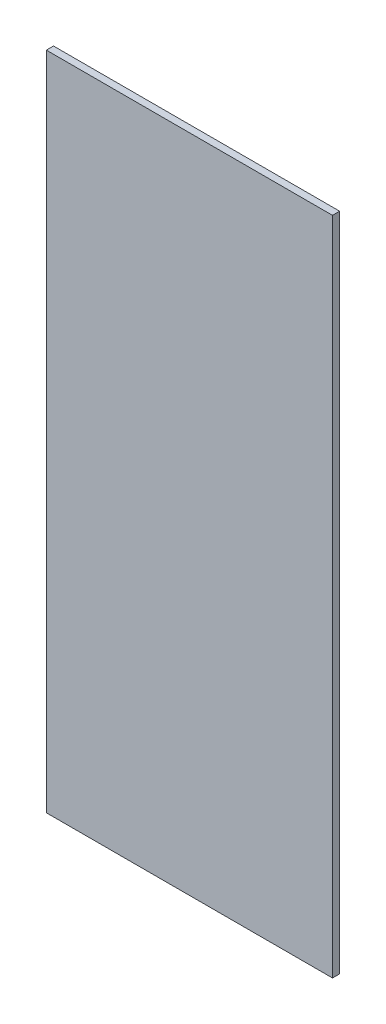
ISO-10303-21;
HEADER;
FILE_DESCRIPTION(('STEP AP214'),'2;1');
FILE_NAME('part.step','',(''),(''),'','','');
FILE_SCHEMA(('AUTOMOTIVE_DESIGN { 1 0 10303 214 1 1 1 1 }'));
ENDSEC;
DATA;
#1=APPLICATION_CONTEXT('core data for automotive mechanical design processes');
#2=APPLICATION_PROTOCOL_DEFINITION('international standard','automotive_design',2000,#1);
#3=PRODUCT_CONTEXT('',#1,'mechanical');
#4=PRODUCT('Part','Part','',(#3));
#5=PRODUCT_RELATED_PRODUCT_CATEGORY('part','',(#4));
#6=PRODUCT_DEFINITION_FORMATION('','',#4);
#7=PRODUCT_DEFINITION_CONTEXT('part definition',#1,'design');
#8=PRODUCT_DEFINITION('design','',#6,#7);
#9=PRODUCT_DEFINITION_SHAPE('','',#8);
#10=(LENGTH_UNIT() NAMED_UNIT(*) SI_UNIT(.MILLI.,.METRE.));
#11=(NAMED_UNIT(*) PLANE_ANGLE_UNIT() SI_UNIT($,.RADIAN.));
#12=(NAMED_UNIT(*) SI_UNIT($,.STERADIAN.) SOLID_ANGLE_UNIT());
#13=UNCERTAINTY_MEASURE_WITH_UNIT(LENGTH_MEASURE(1.E-05),#10,'distance_accuracy_value','');
#14=(GEOMETRIC_REPRESENTATION_CONTEXT(3) GLOBAL_UNCERTAINTY_ASSIGNED_CONTEXT((#13)) GLOBAL_UNIT_ASSIGNED_CONTEXT((#10,
#11,#12)) REPRESENTATION_CONTEXT('',''));
#15=CARTESIAN_POINT('',(0.,0.,0.));
#16=DIRECTION('',(0.,0.,1.));
#17=DIRECTION('',(1.,0.,0.));
#18=AXIS2_PLACEMENT_3D('',#15,#16,#17);
#19=CARTESIAN_POINT('',(300.,692.5,15.));
#20=DIRECTION('',(-1.,0.,0.));
#21=DIRECTION('',(0.,-1.,0.));
#22=AXIS2_PLACEMENT_3D('',#19,#20,#21);
#23=PLANE('',#22);
#24=DIRECTION('',(0.,1.,0.));
#25=VECTOR('',#24,1.);
#26=CARTESIAN_POINT('',(300.,692.5,0.));
#27=LINE('',#26,#25);
#28=CARTESIAN_POINT('',(300.,-692.5,0.));
#29=VERTEX_POINT('',#28);
#30=CARTESIAN_POINT('',(300.,692.5,0.));
#31=VERTEX_POINT('',#30);
#32=EDGE_CURVE('E111',#29,#31,#27,.T.);
#33=ORIENTED_EDGE('',*,*,#32,.T.);
#34=DIRECTION('',(0.,0.,-1.));
#35=VECTOR('',#34,1.);
#36=CARTESIAN_POINT('',(300.,692.5,15.));
#37=LINE('',#36,#35);
#38=CARTESIAN_POINT('',(300.,692.5,15.));
#39=VERTEX_POINT('',#38);
#40=EDGE_CURVE('E11',#39,#31,#37,.T.);
#41=ORIENTED_EDGE('',*,*,#40,.F.);
#42=DIRECTION('',(0.,1.,0.));
#43=VECTOR('',#42,1.);
#44=CARTESIAN_POINT('',(300.,692.5,15.));
#45=LINE('',#44,#43);
#46=CARTESIAN_POINT('',(300.,-692.5,15.));
#47=VERTEX_POINT('',#46);
#48=EDGE_CURVE('E95',#47,#39,#45,.T.);
#49=ORIENTED_EDGE('',*,*,#48,.F.);
#50=DIRECTION('',(0.,0.,-1.));
#51=VECTOR('',#50,1.);
#52=CARTESIAN_POINT('',(300.,-692.5,15.));
#53=LINE('',#52,#51);
#54=EDGE_CURVE('E107',#47,#29,#53,.T.);
#55=ORIENTED_EDGE('',*,*,#54,.T.);
#56=EDGE_LOOP('',(#33,#41,#49,#55));
#57=FACE_BOUND('',#56,.T.);
#58=ADVANCED_FACE('F43',(#57),#23,.F.);
#59=CARTESIAN_POINT('',(-300.,692.5,15.));
#60=DIRECTION('',(0.,-1.,0.));
#61=DIRECTION('',(0.,0.,-1.));
#62=AXIS2_PLACEMENT_3D('',#59,#60,#61);
#63=PLANE('',#62);
#64=DIRECTION('',(-1.,0.,0.));
#65=VECTOR('',#64,1.);
#66=CARTESIAN_POINT('',(-300.,692.5,0.));
#67=LINE('',#66,#65);
#68=CARTESIAN_POINT('',(-300.,692.5,0.));
#69=VERTEX_POINT('',#68);
#70=EDGE_CURVE('E100',#31,#69,#67,.T.);
#71=ORIENTED_EDGE('',*,*,#70,.T.);
#72=DIRECTION('',(0.,0.,-1.));
#73=VECTOR('',#72,1.);
#74=CARTESIAN_POINT('',(-300.,692.5,15.));
#75=LINE('',#74,#73);
#76=CARTESIAN_POINT('',(-300.,692.5,15.));
#77=VERTEX_POINT('',#76);
#78=EDGE_CURVE('E52',#77,#69,#75,.T.);
#79=ORIENTED_EDGE('',*,*,#78,.F.);
#80=DIRECTION('',(-1.,0.,0.));
#81=VECTOR('',#80,1.);
#82=CARTESIAN_POINT('',(-300.,692.5,15.));
#83=LINE('',#82,#81);
#84=EDGE_CURVE('E90',#39,#77,#83,.T.);
#85=ORIENTED_EDGE('',*,*,#84,.F.);
#86=ORIENTED_EDGE('',*,*,#40,.T.);
#87=EDGE_LOOP('',(#71,#79,#85,#86));
#88=FACE_BOUND('',#87,.T.);
#89=ADVANCED_FACE('F99',(#88),#63,.F.);
#90=CARTESIAN_POINT('',(-300.,692.5,15.));
#91=DIRECTION('',(1.,0.,0.));
#92=DIRECTION('',(0.,1.,0.));
#93=AXIS2_PLACEMENT_3D('',#90,#91,#92);
#94=PLANE('',#93);
#95=DIRECTION('',(0.,-1.,0.));
#96=VECTOR('',#95,1.);
#97=CARTESIAN_POINT('',(-300.,692.5,0.));
#98=LINE('',#97,#96);
#99=CARTESIAN_POINT('',(-300.,-692.5,0.));
#100=VERTEX_POINT('',#99);
#101=EDGE_CURVE('E77',#69,#100,#98,.T.);
#102=ORIENTED_EDGE('',*,*,#101,.T.);
#103=DIRECTION('',(0.,0.,-1.));
#104=VECTOR('',#103,1.);
#105=CARTESIAN_POINT('',(-300.,-692.5,15.));
#106=LINE('',#105,#104);
#107=CARTESIAN_POINT('',(-300.,-692.5,15.));
#108=VERTEX_POINT('',#107);
#109=EDGE_CURVE('E102',#108,#100,#106,.T.);
#110=ORIENTED_EDGE('',*,*,#109,.F.);
#111=DIRECTION('',(0.,-1.,0.));
#112=VECTOR('',#111,1.);
#113=CARTESIAN_POINT('',(-300.,692.5,15.));
#114=LINE('',#113,#112);
#115=EDGE_CURVE('E93',#77,#108,#114,.T.);
#116=ORIENTED_EDGE('',*,*,#115,.F.);
#117=ORIENTED_EDGE('',*,*,#78,.T.);
#118=EDGE_LOOP('',(#102,#110,#116,#117));
#119=FACE_BOUND('',#118,.T.);
#120=ADVANCED_FACE('F103',(#119),#94,.F.);
#121=CARTESIAN_POINT('',(-300.,-692.5,15.));
#122=DIRECTION('',(0.,1.,0.));
#123=DIRECTION('',(0.,0.,1.));
#124=AXIS2_PLACEMENT_3D('',#121,#122,#123);
#125=PLANE('',#124);
#126=DIRECTION('',(1.,0.,0.));
#127=VECTOR('',#126,1.);
#128=CARTESIAN_POINT('',(-300.,-692.5,0.));
#129=LINE('',#128,#127);
#130=EDGE_CURVE('E83',#100,#29,#129,.T.);
#131=ORIENTED_EDGE('',*,*,#130,.T.);
#132=ORIENTED_EDGE('',*,*,#54,.F.);
#133=DIRECTION('',(1.,0.,0.));
#134=VECTOR('',#133,1.);
#135=CARTESIAN_POINT('',(-300.,-692.5,15.));
#136=LINE('',#135,#134);
#137=EDGE_CURVE('E60',#108,#47,#136,.T.);
#138=ORIENTED_EDGE('',*,*,#137,.F.);
#139=ORIENTED_EDGE('',*,*,#109,.T.);
#140=EDGE_LOOP('',(#131,#132,#138,#139));
#141=FACE_BOUND('',#140,.T.);
#142=ADVANCED_FACE('F124',(#141),#125,.F.);
#143=CARTESIAN_POINT('',(0.,0.,15.));
#144=DIRECTION('',(0.,0.,1.));
#145=DIRECTION('',(1.,0.,0.));
#146=AXIS2_PLACEMENT_3D('',#143,#144,#145);
#147=PLANE('',#146);
#148=ORIENTED_EDGE('',*,*,#48,.T.);
#149=ORIENTED_EDGE('',*,*,#84,.T.);
#150=ORIENTED_EDGE('',*,*,#115,.T.);
#151=ORIENTED_EDGE('',*,*,#137,.T.);
#152=EDGE_LOOP('',(#148,#149,#150,#151));
#153=FACE_BOUND('',#152,.T.);
#154=ADVANCED_FACE('F91',(#153),#147,.T.);
#155=CARTESIAN_POINT('',(0.,0.,0.));
#156=DIRECTION('',(0.,0.,1.));
#157=DIRECTION('',(1.,0.,0.));
#158=AXIS2_PLACEMENT_3D('',#155,#156,#157);
#159=PLANE('',#158);
#160=ORIENTED_EDGE('',*,*,#32,.F.);
#161=ORIENTED_EDGE('',*,*,#130,.F.);
#162=ORIENTED_EDGE('',*,*,#101,.F.);
#163=ORIENTED_EDGE('',*,*,#70,.F.);
#164=EDGE_LOOP('',(#160,#161,#162,#163));
#165=FACE_BOUND('',#164,.T.);
#166=ADVANCED_FACE('F127',(#165),#159,.F.);
#167=CLOSED_SHELL('',(#58,#89,#120,#142,#154,#166));
#168=MANIFOLD_SOLID_BREP('B2',#167);
#169=ADVANCED_BREP_SHAPE_REPRESENTATION('',(#18,#168),#14);
#170=SHAPE_DEFINITION_REPRESENTATION(#9,#169);
ENDSEC;
END-ISO-10303-21;
